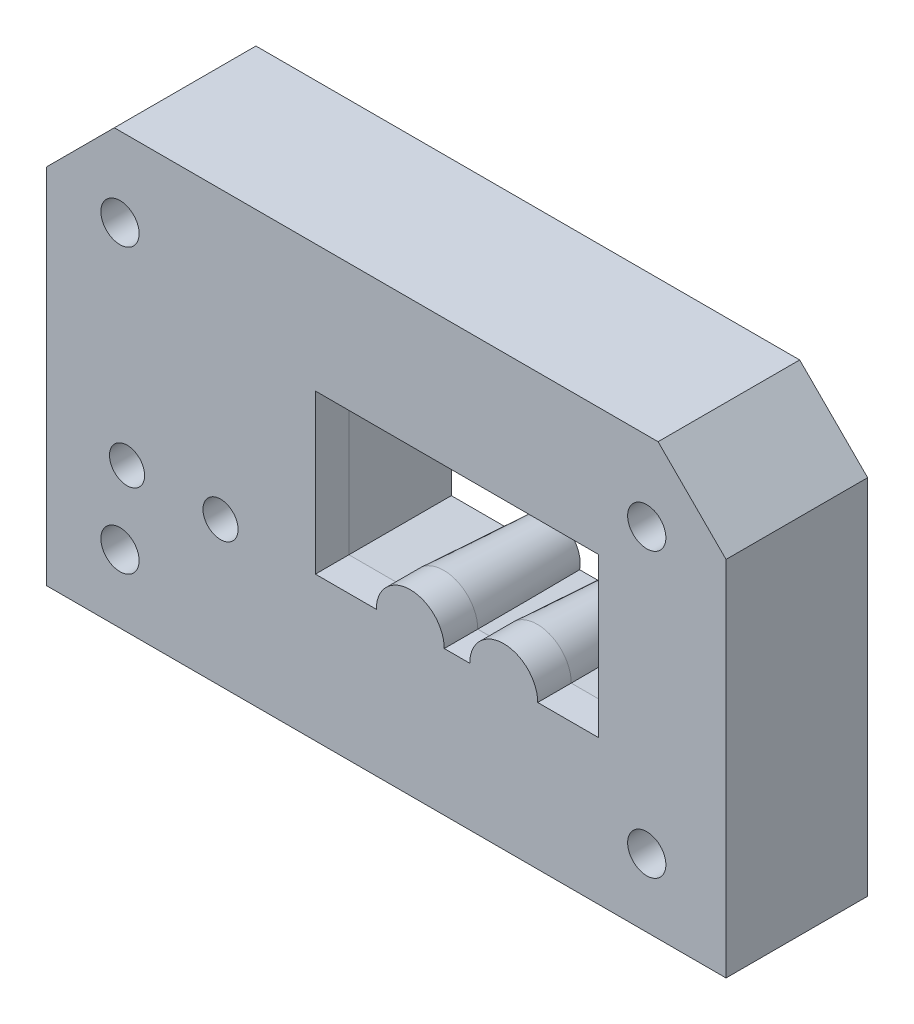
ISO-10303-21;
HEADER;
FILE_DESCRIPTION(('STEP AP214'),'2;1');
FILE_NAME('part.step','',(''),(''),'','','');
FILE_SCHEMA(('AUTOMOTIVE_DESIGN { 1 0 10303 214 1 1 1 1 }'));
ENDSEC;
DATA;
#1=APPLICATION_CONTEXT('core data for automotive mechanical design processes');
#2=APPLICATION_PROTOCOL_DEFINITION('international standard','automotive_design',2000,#1);
#3=PRODUCT_CONTEXT('',#1,'mechanical');
#4=PRODUCT('Part','Part','',(#3));
#5=PRODUCT_RELATED_PRODUCT_CATEGORY('part','',(#4));
#6=PRODUCT_DEFINITION_FORMATION('','',#4);
#7=PRODUCT_DEFINITION_CONTEXT('part definition',#1,'design');
#8=PRODUCT_DEFINITION('design','',#6,#7);
#9=PRODUCT_DEFINITION_SHAPE('','',#8);
#10=(LENGTH_UNIT() NAMED_UNIT(*) SI_UNIT(.MILLI.,.METRE.));
#11=(NAMED_UNIT(*) PLANE_ANGLE_UNIT() SI_UNIT($,.RADIAN.));
#12=(NAMED_UNIT(*) SI_UNIT($,.STERADIAN.) SOLID_ANGLE_UNIT());
#13=UNCERTAINTY_MEASURE_WITH_UNIT(LENGTH_MEASURE(1.E-05),#10,'distance_accuracy_value','');
#14=(GEOMETRIC_REPRESENTATION_CONTEXT(3) GLOBAL_UNCERTAINTY_ASSIGNED_CONTEXT((#13)) GLOBAL_UNIT_ASSIGNED_CONTEXT((#10,
#11,#12)) REPRESENTATION_CONTEXT('',''));
#15=CARTESIAN_POINT('',(0.,0.,0.));
#16=DIRECTION('',(0.,0.,1.));
#17=DIRECTION('',(1.,0.,0.));
#18=AXIS2_PLACEMENT_3D('',#15,#16,#17);
#19=CARTESIAN_POINT('',(205.,123.,25.));
#20=DIRECTION('',(0.,0.,-1.));
#21=DIRECTION('',(-1.,0.,0.));
#22=AXIS2_PLACEMENT_3D('',#19,#20,#21);
#23=PLANE('',#22);
#24=CARTESIAN_POINT('',(218.,185.,25.));
#25=DIRECTION('',(0.,0.,-1.));
#26=DIRECTION('',(-1.,0.,0.));
#27=AXIS2_PLACEMENT_3D('',#24,#25,#26);
#28=CIRCLE('',#27,3.37500000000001);
#29=CARTESIAN_POINT('',(214.625,185.,25.));
#30=VERTEX_POINT('',#29);
#31=EDGE_CURVE('E509',#30,#30,#28,.T.);
#32=ORIENTED_EDGE('',*,*,#31,.T.);
#33=EDGE_LOOP('',(#32));
#34=FACE_BOUND('',#33,.T.);
#35=CARTESIAN_POINT('',(218.,135.,25.));
#36=DIRECTION('',(0.,0.,-1.));
#37=DIRECTION('',(-1.,0.,0.));
#38=AXIS2_PLACEMENT_3D('',#35,#36,#37);
#39=CIRCLE('',#38,3.37500000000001);
#40=CARTESIAN_POINT('',(214.625,135.,25.));
#41=VERTEX_POINT('',#40);
#42=EDGE_CURVE('E503',#41,#41,#39,.T.);
#43=ORIENTED_EDGE('',*,*,#42,.T.);
#44=EDGE_LOOP('',(#43));
#45=FACE_BOUND('',#44,.T.);
#46=CARTESIAN_POINT('',(311.,185.,25.));
#47=DIRECTION('',(0.,0.,-1.));
#48=DIRECTION('',(-1.,0.,0.));
#49=AXIS2_PLACEMENT_3D('',#46,#47,#48);
#50=CIRCLE('',#49,3.37500000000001);
#51=CARTESIAN_POINT('',(307.625,185.,25.));
#52=VERTEX_POINT('',#51);
#53=EDGE_CURVE('E497',#52,#52,#50,.T.);
#54=ORIENTED_EDGE('',*,*,#53,.T.);
#55=EDGE_LOOP('',(#54));
#56=FACE_BOUND('',#55,.T.);
#57=CARTESIAN_POINT('',(311.,135.,25.));
#58=DIRECTION('',(0.,0.,-1.));
#59=DIRECTION('',(-1.,0.,0.));
#60=AXIS2_PLACEMENT_3D('',#57,#58,#59);
#61=CIRCLE('',#60,3.37500000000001);
#62=CARTESIAN_POINT('',(307.625,135.,25.));
#63=VERTEX_POINT('',#62);
#64=EDGE_CURVE('E491',#63,#63,#61,.T.);
#65=ORIENTED_EDGE('',*,*,#64,.T.);
#66=EDGE_LOOP('',(#65));
#67=FACE_BOUND('',#66,.T.);
#68=CARTESIAN_POINT('',(219.25,148.5,25.));
#69=DIRECTION('',(0.,0.,1.));
#70=DIRECTION('',(1.,0.,0.));
#71=AXIS2_PLACEMENT_3D('',#68,#69,#70);
#72=CIRCLE('',#71,3.09999999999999);
#73=CARTESIAN_POINT('',(222.35,148.5,25.));
#74=VERTEX_POINT('',#73);
#75=EDGE_CURVE('E259',#74,#74,#72,.T.);
#76=ORIENTED_EDGE('',*,*,#75,.F.);
#77=EDGE_LOOP('',(#76));
#78=FACE_BOUND('',#77,.T.);
#79=DIRECTION('',(-1.,0.,0.));
#80=VECTOR('',#79,1.);
#81=CARTESIAN_POINT('',(325.,199.,25.));
#82=LINE('',#81,#80);
#83=CARTESIAN_POINT('',(313.,199.,25.));
#84=VERTEX_POINT('',#83);
#85=CARTESIAN_POINT('',(217.,199.,25.));
#86=VERTEX_POINT('',#85);
#87=EDGE_CURVE('E320',#84,#86,#82,.T.);
#88=ORIENTED_EDGE('',*,*,#87,.T.);
#89=DIRECTION('',(0.707106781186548,0.707106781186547,0.));
#90=VECTOR('',#89,1.);
#91=CARTESIAN_POINT('',(205.,187.,25.));
#92=LINE('',#91,#90);
#93=CARTESIAN_POINT('',(205.,187.,25.));
#94=VERTEX_POINT('',#93);
#95=EDGE_CURVE('E345',#86,#94,#92,.F.);
#96=ORIENTED_EDGE('',*,*,#95,.T.);
#97=DIRECTION('',(0.,-1.,0.));
#98=VECTOR('',#97,1.);
#99=CARTESIAN_POINT('',(205.,123.,25.));
#100=LINE('',#99,#98);
#101=CARTESIAN_POINT('',(205.,123.,25.));
#102=VERTEX_POINT('',#101);
#103=EDGE_CURVE('E323',#94,#102,#100,.T.);
#104=ORIENTED_EDGE('',*,*,#103,.T.);
#105=DIRECTION('',(1.,0.,0.));
#106=VECTOR('',#105,1.);
#107=CARTESIAN_POINT('',(325.,123.,25.));
#108=LINE('',#107,#106);
#109=CARTESIAN_POINT('',(325.,123.,25.));
#110=VERTEX_POINT('',#109);
#111=EDGE_CURVE('E314',#102,#110,#108,.T.);
#112=ORIENTED_EDGE('',*,*,#111,.T.);
#113=DIRECTION('',(0.,1.,0.));
#114=VECTOR('',#113,1.);
#115=CARTESIAN_POINT('',(325.,123.,25.));
#116=LINE('',#115,#114);
#117=CARTESIAN_POINT('',(325.,187.,25.));
#118=VERTEX_POINT('',#117);
#119=EDGE_CURVE('E317',#110,#118,#116,.T.);
#120=ORIENTED_EDGE('',*,*,#119,.T.);
#121=DIRECTION('',(0.707106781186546,-0.707106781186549,0.));
#122=VECTOR('',#121,1.);
#123=CARTESIAN_POINT('',(313.,199.,25.));
#124=LINE('',#123,#122);
#125=EDGE_CURVE('E343',#118,#84,#124,.F.);
#126=ORIENTED_EDGE('',*,*,#125,.T.);
#127=EDGE_LOOP('',(#88,#96,#104,#112,#120,#126));
#128=FACE_BOUND('',#127,.T.);
#129=CARTESIAN_POINT('',(269.25,148.5,25.));
#130=DIRECTION('',(0.,0.,-1.));
#131=DIRECTION('',(1.,0.,0.));
#132=AXIS2_PLACEMENT_3D('',#129,#130,#131);
#133=CIRCLE('',#132,6.00000000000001);
#134=CARTESIAN_POINT('',(263.25,148.5,25.));
#135=VERTEX_POINT('',#134);
#136=CARTESIAN_POINT('',(275.25,148.5,25.));
#137=VERTEX_POINT('',#136);
#138=EDGE_CURVE('E262',#135,#137,#133,.T.);
#139=ORIENTED_EDGE('',*,*,#138,.F.);
#140=DIRECTION('',(1.,0.,0.));
#141=VECTOR('',#140,1.);
#142=CARTESIAN_POINT('',(263.25,148.5,25.));
#143=LINE('',#142,#141);
#144=CARTESIAN_POINT('',(252.5,148.5,25.));
#145=VERTEX_POINT('',#144);
#146=EDGE_CURVE('E277',#145,#135,#143,.T.);
#147=ORIENTED_EDGE('',*,*,#146,.F.);
#148=DIRECTION('',(0.,-1.,0.));
#149=VECTOR('',#148,1.);
#150=CARTESIAN_POINT('',(252.5,176.5,25.));
#151=LINE('',#150,#149);
#152=CARTESIAN_POINT('',(252.5,176.5,25.));
#153=VERTEX_POINT('',#152);
#154=EDGE_CURVE('E274',#153,#145,#151,.T.);
#155=ORIENTED_EDGE('',*,*,#154,.F.);
#156=DIRECTION('',(-1.,0.,0.));
#157=VECTOR('',#156,1.);
#158=CARTESIAN_POINT('',(302.5,176.5,25.));
#159=LINE('',#158,#157);
#160=CARTESIAN_POINT('',(302.5,176.5,25.));
#161=VERTEX_POINT('',#160);
#162=EDGE_CURVE('E272',#161,#153,#159,.T.);
#163=ORIENTED_EDGE('',*,*,#162,.F.);
#164=DIRECTION('',(0.,1.,0.));
#165=VECTOR('',#164,1.);
#166=CARTESIAN_POINT('',(302.5,176.5,25.));
#167=LINE('',#166,#165);
#168=CARTESIAN_POINT('',(302.5,148.5,25.));
#169=VERTEX_POINT('',#168);
#170=EDGE_CURVE('E270',#169,#161,#167,.T.);
#171=ORIENTED_EDGE('',*,*,#170,.F.);
#172=DIRECTION('',(1.,0.,0.));
#173=VECTOR('',#172,1.);
#174=CARTESIAN_POINT('',(302.5,148.5,25.));
#175=LINE('',#174,#173);
#176=CARTESIAN_POINT('',(291.75,148.5,25.));
#177=VERTEX_POINT('',#176);
#178=EDGE_CURVE('E268',#177,#169,#175,.T.);
#179=ORIENTED_EDGE('',*,*,#178,.F.);
#180=CARTESIAN_POINT('',(285.75,148.5,25.));
#181=DIRECTION('',(0.,0.,-1.));
#182=DIRECTION('',(1.,0.,0.));
#183=AXIS2_PLACEMENT_3D('',#180,#181,#182);
#184=CIRCLE('',#183,6.00000000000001);
#185=CARTESIAN_POINT('',(279.75,148.5,25.));
#186=VERTEX_POINT('',#185);
#187=EDGE_CURVE('E266',#186,#177,#184,.T.);
#188=ORIENTED_EDGE('',*,*,#187,.F.);
#189=DIRECTION('',(1.,0.,0.));
#190=VECTOR('',#189,1.);
#191=CARTESIAN_POINT('',(279.75,148.5,25.));
#192=LINE('',#191,#190);
#193=EDGE_CURVE('E264',#137,#186,#192,.T.);
#194=ORIENTED_EDGE('',*,*,#193,.F.);
#195=EDGE_LOOP('',(#139,#147,#155,#163,#171,#179,#188,#194));
#196=FACE_BOUND('',#195,.T.);
#197=CARTESIAN_POINT('',(235.75,148.5,25.));
#198=DIRECTION('',(0.,0.,1.));
#199=DIRECTION('',(1.,0.,0.));
#200=AXIS2_PLACEMENT_3D('',#197,#198,#199);
#201=CIRCLE('',#200,3.09999999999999);
#202=CARTESIAN_POINT('',(238.85,148.5,25.));
#203=VERTEX_POINT('',#202);
#204=EDGE_CURVE('E256',#203,#203,#201,.T.);
#205=ORIENTED_EDGE('',*,*,#204,.F.);
#206=EDGE_LOOP('',(#205));
#207=FACE_BOUND('',#206,.T.);
#208=ADVANCED_FACE('F31',(#34,#45,#56,#67,#78,#128,#196,#207),#23,.F.);
#209=CARTESIAN_POINT('',(205.,123.,0.));
#210=DIRECTION('',(0.,0.,-1.));
#211=DIRECTION('',(-1.,0.,0.));
#212=AXIS2_PLACEMENT_3D('',#209,#210,#211);
#213=PLANE('',#212);
#214=CARTESIAN_POINT('',(218.,185.,0.));
#215=DIRECTION('',(0.,0.,-1.));
#216=DIRECTION('',(-1.,0.,0.));
#217=AXIS2_PLACEMENT_3D('',#214,#215,#216);
#218=CIRCLE('',#217,3.37500000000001);
#219=CARTESIAN_POINT('',(214.625,185.,0.));
#220=VERTEX_POINT('',#219);
#221=EDGE_CURVE('E511',#220,#220,#218,.T.);
#222=ORIENTED_EDGE('',*,*,#221,.F.);
#223=EDGE_LOOP('',(#222));
#224=FACE_BOUND('',#223,.T.);
#225=CARTESIAN_POINT('',(218.,135.,0.));
#226=DIRECTION('',(0.,0.,-1.));
#227=DIRECTION('',(-1.,0.,0.));
#228=AXIS2_PLACEMENT_3D('',#225,#226,#227);
#229=CIRCLE('',#228,3.37500000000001);
#230=CARTESIAN_POINT('',(214.625,135.,0.));
#231=VERTEX_POINT('',#230);
#232=EDGE_CURVE('E506',#231,#231,#229,.T.);
#233=ORIENTED_EDGE('',*,*,#232,.F.);
#234=EDGE_LOOP('',(#233));
#235=FACE_BOUND('',#234,.T.);
#236=CARTESIAN_POINT('',(311.,185.,0.));
#237=DIRECTION('',(0.,0.,-1.));
#238=DIRECTION('',(-1.,0.,0.));
#239=AXIS2_PLACEMENT_3D('',#236,#237,#238);
#240=CIRCLE('',#239,3.37500000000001);
#241=CARTESIAN_POINT('',(307.625,185.,0.));
#242=VERTEX_POINT('',#241);
#243=EDGE_CURVE('E500',#242,#242,#240,.T.);
#244=ORIENTED_EDGE('',*,*,#243,.F.);
#245=EDGE_LOOP('',(#244));
#246=FACE_BOUND('',#245,.T.);
#247=CARTESIAN_POINT('',(311.,135.,0.));
#248=DIRECTION('',(0.,0.,-1.));
#249=DIRECTION('',(-1.,0.,0.));
#250=AXIS2_PLACEMENT_3D('',#247,#248,#249);
#251=CIRCLE('',#250,3.37500000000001);
#252=CARTESIAN_POINT('',(307.625,135.,0.));
#253=VERTEX_POINT('',#252);
#254=EDGE_CURVE('E494',#253,#253,#251,.T.);
#255=ORIENTED_EDGE('',*,*,#254,.F.);
#256=EDGE_LOOP('',(#255));
#257=FACE_BOUND('',#256,.T.);
#258=CARTESIAN_POINT('',(219.25,148.5,0.));
#259=DIRECTION('',(0.,0.,-1.));
#260=DIRECTION('',(-1.,0.,0.));
#261=AXIS2_PLACEMENT_3D('',#258,#259,#260);
#262=CIRCLE('',#261,4.09999999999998);
#263=CARTESIAN_POINT('',(215.15,148.5,0.));
#264=VERTEX_POINT('',#263);
#265=EDGE_CURVE('E487',#264,#264,#262,.T.);
#266=ORIENTED_EDGE('',*,*,#265,.F.);
#267=EDGE_LOOP('',(#266));
#268=FACE_BOUND('',#267,.T.);
#269=CARTESIAN_POINT('',(269.25,148.5,0.));
#270=DIRECTION('',(0.,0.,1.));
#271=DIRECTION('',(-1.,0.,0.));
#272=AXIS2_PLACEMENT_3D('',#269,#270,#271);
#273=CIRCLE('',#272,5.00000000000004);
#274=CARTESIAN_POINT('',(274.148979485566,147.5,0.));
#275=VERTEX_POINT('',#274);
#276=CARTESIAN_POINT('',(264.351020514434,147.5,0.));
#277=VERTEX_POINT('',#276);
#278=EDGE_CURVE('E47',#275,#277,#273,.T.);
#279=ORIENTED_EDGE('',*,*,#278,.F.);
#280=DIRECTION('',(-1.,0.,0.));
#281=VECTOR('',#280,1.);
#282=CARTESIAN_POINT('',(280.851020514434,147.5,0.));
#283=LINE('',#282,#281);
#284=CARTESIAN_POINT('',(280.851020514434,147.5,0.));
#285=VERTEX_POINT('',#284);
#286=EDGE_CURVE('E190',#285,#275,#283,.T.);
#287=ORIENTED_EDGE('',*,*,#286,.F.);
#288=CARTESIAN_POINT('',(285.75,148.5,0.));
#289=DIRECTION('',(0.,0.,1.));
#290=DIRECTION('',(-1.,0.,0.));
#291=AXIS2_PLACEMENT_3D('',#288,#289,#290);
#292=CIRCLE('',#291,4.99999999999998);
#293=CARTESIAN_POINT('',(290.648979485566,147.5,0.));
#294=VERTEX_POINT('',#293);
#295=EDGE_CURVE('E187',#294,#285,#292,.T.);
#296=ORIENTED_EDGE('',*,*,#295,.F.);
#297=DIRECTION('',(-1.,0.,0.));
#298=VECTOR('',#297,1.);
#299=CARTESIAN_POINT('',(303.5,147.5,0.));
#300=LINE('',#299,#298);
#301=CARTESIAN_POINT('',(303.5,147.5,0.));
#302=VERTEX_POINT('',#301);
#303=EDGE_CURVE('E184',#302,#294,#300,.T.);
#304=ORIENTED_EDGE('',*,*,#303,.F.);
#305=DIRECTION('',(0.,-1.,0.));
#306=VECTOR('',#305,1.);
#307=CARTESIAN_POINT('',(303.5,177.5,0.));
#308=LINE('',#307,#306);
#309=CARTESIAN_POINT('',(303.5,177.5,0.));
#310=VERTEX_POINT('',#309);
#311=EDGE_CURVE('E178',#310,#302,#308,.T.);
#312=ORIENTED_EDGE('',*,*,#311,.F.);
#313=DIRECTION('',(1.,0.,0.));
#314=VECTOR('',#313,1.);
#315=CARTESIAN_POINT('',(251.5,177.5,0.));
#316=LINE('',#315,#314);
#317=CARTESIAN_POINT('',(251.5,177.5,0.));
#318=VERTEX_POINT('',#317);
#319=EDGE_CURVE('E176',#318,#310,#316,.T.);
#320=ORIENTED_EDGE('',*,*,#319,.F.);
#321=DIRECTION('',(0.,1.,0.));
#322=VECTOR('',#321,1.);
#323=CARTESIAN_POINT('',(251.5,147.5,0.));
#324=LINE('',#323,#322);
#325=CARTESIAN_POINT('',(251.5,147.5,0.));
#326=VERTEX_POINT('',#325);
#327=EDGE_CURVE('E159',#326,#318,#324,.T.);
#328=ORIENTED_EDGE('',*,*,#327,.F.);
#329=DIRECTION('',(-1.,0.,0.));
#330=VECTOR('',#329,1.);
#331=CARTESIAN_POINT('',(264.351020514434,147.5,0.));
#332=LINE('',#331,#330);
#333=EDGE_CURVE('E168',#277,#326,#332,.T.);
#334=ORIENTED_EDGE('',*,*,#333,.F.);
#335=EDGE_LOOP('',(#279,#287,#296,#304,#312,#320,#328,#334));
#336=FACE_BOUND('',#335,.T.);
#337=CARTESIAN_POINT('',(235.75,148.5,0.));
#338=DIRECTION('',(0.,0.,-1.));
#339=DIRECTION('',(-1.,0.,0.));
#340=AXIS2_PLACEMENT_3D('',#337,#338,#339);
#341=CIRCLE('',#340,4.09999999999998);
#342=CARTESIAN_POINT('',(231.65,148.5,0.));
#343=VERTEX_POINT('',#342);
#344=EDGE_CURVE('E252',#343,#343,#341,.T.);
#345=ORIENTED_EDGE('',*,*,#344,.F.);
#346=EDGE_LOOP('',(#345));
#347=FACE_BOUND('',#346,.T.);
#348=DIRECTION('',(0.,-1.,0.));
#349=VECTOR('',#348,1.);
#350=CARTESIAN_POINT('',(205.,123.,0.));
#351=LINE('',#350,#349);
#352=CARTESIAN_POINT('',(205.,187.,0.));
#353=VERTEX_POINT('',#352);
#354=CARTESIAN_POINT('',(205.,123.,0.));
#355=VERTEX_POINT('',#354);
#356=EDGE_CURVE('E312',#353,#355,#351,.T.);
#357=ORIENTED_EDGE('',*,*,#356,.F.);
#358=DIRECTION('',(-0.707106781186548,-0.707106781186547,0.));
#359=VECTOR('',#358,1.);
#360=CARTESIAN_POINT('',(173.,155.,0.));
#361=LINE('',#360,#359);
#362=CARTESIAN_POINT('',(217.,199.,0.));
#363=VERTEX_POINT('',#362);
#364=EDGE_CURVE('E336',#353,#363,#361,.F.);
#365=ORIENTED_EDGE('',*,*,#364,.T.);
#366=DIRECTION('',(-1.,0.,0.));
#367=VECTOR('',#366,1.);
#368=CARTESIAN_POINT('',(325.,199.,0.));
#369=LINE('',#368,#367);
#370=CARTESIAN_POINT('',(313.,199.,0.));
#371=VERTEX_POINT('',#370);
#372=EDGE_CURVE('E309',#371,#363,#369,.T.);
#373=ORIENTED_EDGE('',*,*,#372,.F.);
#374=DIRECTION('',(-0.707106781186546,0.707106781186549,0.));
#375=VECTOR('',#374,1.);
#376=CARTESIAN_POINT('',(297.,215.,0.));
#377=LINE('',#376,#375);
#378=CARTESIAN_POINT('',(325.,187.,0.));
#379=VERTEX_POINT('',#378);
#380=EDGE_CURVE('E334',#371,#379,#377,.F.);
#381=ORIENTED_EDGE('',*,*,#380,.T.);
#382=DIRECTION('',(0.,1.,0.));
#383=VECTOR('',#382,1.);
#384=CARTESIAN_POINT('',(325.,123.,0.));
#385=LINE('',#384,#383);
#386=CARTESIAN_POINT('',(325.,123.,0.));
#387=VERTEX_POINT('',#386);
#388=EDGE_CURVE('E306',#387,#379,#385,.T.);
#389=ORIENTED_EDGE('',*,*,#388,.F.);
#390=DIRECTION('',(1.,0.,0.));
#391=VECTOR('',#390,1.);
#392=CARTESIAN_POINT('',(325.,123.,0.));
#393=LINE('',#392,#391);
#394=EDGE_CURVE('E303',#355,#387,#393,.T.);
#395=ORIENTED_EDGE('',*,*,#394,.F.);
#396=EDGE_LOOP('',(#357,#365,#373,#381,#389,#395));
#397=FACE_BOUND('',#396,.T.);
#398=ADVANCED_FACE('F172',(#224,#235,#246,#257,#268,#336,#347,#397),#213,.T.);
#399=CARTESIAN_POINT('',(325.,123.,25.));
#400=DIRECTION('',(0.,1.,0.));
#401=DIRECTION('',(-1.,0.,0.));
#402=AXIS2_PLACEMENT_3D('',#399,#400,#401);
#403=PLANE('',#402);
#404=ORIENTED_EDGE('',*,*,#394,.T.);
#405=DIRECTION('',(0.,0.,-1.));
#406=VECTOR('',#405,1.);
#407=CARTESIAN_POINT('',(325.,123.,25.));
#408=LINE('',#407,#406);
#409=EDGE_CURVE('E328',#110,#387,#408,.T.);
#410=ORIENTED_EDGE('',*,*,#409,.F.);
#411=ORIENTED_EDGE('',*,*,#111,.F.);
#412=DIRECTION('',(0.,0.,-1.));
#413=VECTOR('',#412,1.);
#414=CARTESIAN_POINT('',(205.,123.,25.));
#415=LINE('',#414,#413);
#416=EDGE_CURVE('E325',#102,#355,#415,.T.);
#417=ORIENTED_EDGE('',*,*,#416,.T.);
#418=EDGE_LOOP('',(#404,#410,#411,#417));
#419=FACE_BOUND('',#418,.T.);
#420=ADVANCED_FACE('F33',(#419),#403,.F.);
#421=CARTESIAN_POINT('',(325.,123.,25.));
#422=DIRECTION('',(-1.,0.,0.));
#423=DIRECTION('',(0.,0.,1.));
#424=AXIS2_PLACEMENT_3D('',#421,#422,#423);
#425=PLANE('',#424);
#426=ORIENTED_EDGE('',*,*,#388,.T.);
#427=DIRECTION('',(0.,0.,1.));
#428=VECTOR('',#427,1.);
#429=CARTESIAN_POINT('',(325.,187.,25.));
#430=LINE('',#429,#428);
#431=EDGE_CURVE('E40',#379,#118,#430,.T.);
#432=ORIENTED_EDGE('',*,*,#431,.T.);
#433=ORIENTED_EDGE('',*,*,#119,.F.);
#434=ORIENTED_EDGE('',*,*,#409,.T.);
#435=EDGE_LOOP('',(#426,#432,#433,#434));
#436=FACE_BOUND('',#435,.T.);
#437=ADVANCED_FACE('F380',(#436),#425,.F.);
#438=CARTESIAN_POINT('',(325.,199.,25.));
#439=DIRECTION('',(0.,-1.,0.));
#440=DIRECTION('',(1.,0.,0.));
#441=AXIS2_PLACEMENT_3D('',#438,#439,#440);
#442=PLANE('',#441);
#443=ORIENTED_EDGE('',*,*,#372,.T.);
#444=DIRECTION('',(0.,0.,1.));
#445=VECTOR('',#444,1.);
#446=CARTESIAN_POINT('',(217.,199.,25.));
#447=LINE('',#446,#445);
#448=EDGE_CURVE('E341',#363,#86,#447,.T.);
#449=ORIENTED_EDGE('',*,*,#448,.T.);
#450=ORIENTED_EDGE('',*,*,#87,.F.);
#451=DIRECTION('',(0.,0.,-1.));
#452=VECTOR('',#451,1.);
#453=CARTESIAN_POINT('',(313.,199.,25.));
#454=LINE('',#453,#452);
#455=EDGE_CURVE('E338',#84,#371,#454,.T.);
#456=ORIENTED_EDGE('',*,*,#455,.T.);
#457=EDGE_LOOP('',(#443,#449,#450,#456));
#458=FACE_BOUND('',#457,.T.);
#459=ADVANCED_FACE('F377',(#458),#442,.F.);
#460=CARTESIAN_POINT('',(205.,123.,25.));
#461=DIRECTION('',(1.,0.,0.));
#462=DIRECTION('',(0.,0.,-1.));
#463=AXIS2_PLACEMENT_3D('',#460,#461,#462);
#464=PLANE('',#463);
#465=ORIENTED_EDGE('',*,*,#103,.F.);
#466=DIRECTION('',(0.,0.,-1.));
#467=VECTOR('',#466,1.);
#468=CARTESIAN_POINT('',(205.,187.,25.));
#469=LINE('',#468,#467);
#470=EDGE_CURVE('E331',#94,#353,#469,.T.);
#471=ORIENTED_EDGE('',*,*,#470,.T.);
#472=ORIENTED_EDGE('',*,*,#356,.T.);
#473=ORIENTED_EDGE('',*,*,#416,.F.);
#474=EDGE_LOOP('',(#465,#471,#472,#473));
#475=FACE_BOUND('',#474,.T.);
#476=ADVANCED_FACE('F373',(#475),#464,.F.);
#477=CARTESIAN_POINT('',(269.25,148.5,25.));
#478=DIRECTION('',(0.,0.,-1.));
#479=DIRECTION('',(-1.,0.,0.));
#480=AXIS2_PLACEMENT_3D('',#477,#478,#479);
#481=CYLINDRICAL_SURFACE('',#480,6.00000000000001);
#482=CARTESIAN_POINT('',(269.25,148.5,19.0811366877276));
#483=DIRECTION('',(0.,0.,1.));
#484=DIRECTION('',(1.,0.,0.));
#485=AXIS2_PLACEMENT_3D('',#482,#483,#484);
#486=CIRCLE('',#485,6.00000000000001);
#487=CARTESIAN_POINT('',(263.25,148.5,19.0811366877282));
#488=VERTEX_POINT('',#487);
#489=CARTESIAN_POINT('',(275.25,148.5,19.0811366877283));
#490=VERTEX_POINT('',#489);
#491=EDGE_CURVE('E240',#488,#490,#486,.F.);
#492=ORIENTED_EDGE('',*,*,#491,.F.);
#493=DIRECTION('',(0.,0.,-1.));
#494=VECTOR('',#493,1.);
#495=CARTESIAN_POINT('',(263.25,148.5,25.));
#496=LINE('',#495,#494);
#497=EDGE_CURVE('E279',#135,#488,#496,.T.);
#498=ORIENTED_EDGE('',*,*,#497,.F.);
#499=ORIENTED_EDGE('',*,*,#138,.T.);
#500=DIRECTION('',(0.,0.,-1.));
#501=VECTOR('',#500,1.);
#502=CARTESIAN_POINT('',(275.25,148.5,25.));
#503=LINE('',#502,#501);
#504=EDGE_CURVE('E300',#137,#490,#503,.T.);
#505=ORIENTED_EDGE('',*,*,#504,.T.);
#506=EDGE_LOOP('',(#492,#498,#499,#505));
#507=FACE_BOUND('',#506,.T.);
#508=ADVANCED_FACE('F376',(#507),#481,.T.);
#509=CARTESIAN_POINT('',(279.75,148.5,25.));
#510=DIRECTION('',(0.,1.,0.));
#511=DIRECTION('',(-1.,0.,0.));
#512=AXIS2_PLACEMENT_3D('',#509,#510,#511);
#513=PLANE('',#512);
#514=DIRECTION('',(1.,0.,0.));
#515=VECTOR('',#514,1.);
#516=CARTESIAN_POINT('',(279.75,148.5,19.0811366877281));
#517=LINE('',#516,#515);
#518=CARTESIAN_POINT('',(279.75,148.5,19.0811366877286));
#519=VERTEX_POINT('',#518);
#520=EDGE_CURVE('E250',#490,#519,#517,.T.);
#521=ORIENTED_EDGE('',*,*,#520,.F.);
#522=ORIENTED_EDGE('',*,*,#504,.F.);
#523=ORIENTED_EDGE('',*,*,#193,.T.);
#524=DIRECTION('',(0.,0.,-1.));
#525=VECTOR('',#524,1.);
#526=CARTESIAN_POINT('',(279.75,148.5,25.));
#527=LINE('',#526,#525);
#528=EDGE_CURVE('E297',#186,#519,#527,.T.);
#529=ORIENTED_EDGE('',*,*,#528,.T.);
#530=EDGE_LOOP('',(#521,#522,#523,#529));
#531=FACE_BOUND('',#530,.T.);
#532=ADVANCED_FACE('F442',(#531),#513,.T.);
#533=CARTESIAN_POINT('',(285.75,148.5,25.));
#534=DIRECTION('',(0.,0.,-1.));
#535=DIRECTION('',(-1.,0.,0.));
#536=AXIS2_PLACEMENT_3D('',#533,#534,#535);
#537=CYLINDRICAL_SURFACE('',#536,6.00000000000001);
#538=CARTESIAN_POINT('',(285.75,148.5,19.0811366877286));
#539=DIRECTION('',(0.,0.,1.));
#540=DIRECTION('',(1.,0.,0.));
#541=AXIS2_PLACEMENT_3D('',#538,#539,#540);
#542=CIRCLE('',#541,6.00000000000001);
#543=CARTESIAN_POINT('',(291.75,148.5,19.0811366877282));
#544=VERTEX_POINT('',#543);
#545=EDGE_CURVE('E248',#519,#544,#542,.F.);
#546=ORIENTED_EDGE('',*,*,#545,.F.);
#547=ORIENTED_EDGE('',*,*,#528,.F.);
#548=ORIENTED_EDGE('',*,*,#187,.T.);
#549=DIRECTION('',(0.,0.,-1.));
#550=VECTOR('',#549,1.);
#551=CARTESIAN_POINT('',(291.75,148.5,25.));
#552=LINE('',#551,#550);
#553=EDGE_CURVE('E294',#177,#544,#552,.T.);
#554=ORIENTED_EDGE('',*,*,#553,.T.);
#555=EDGE_LOOP('',(#546,#547,#548,#554));
#556=FACE_BOUND('',#555,.T.);
#557=ADVANCED_FACE('F438',(#556),#537,.T.);
#558=CARTESIAN_POINT('',(302.5,148.5,25.));
#559=DIRECTION('',(0.,1.,0.));
#560=DIRECTION('',(0.,0.,1.));
#561=AXIS2_PLACEMENT_3D('',#558,#559,#560);
#562=PLANE('',#561);
#563=DIRECTION('',(1.,0.,0.));
#564=VECTOR('',#563,1.);
#565=CARTESIAN_POINT('',(302.5,148.5,19.0811366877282));
#566=LINE('',#565,#564);
#567=CARTESIAN_POINT('',(302.5,148.5,19.0811366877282));
#568=VERTEX_POINT('',#567);
#569=EDGE_CURVE('E246',#544,#568,#566,.T.);
#570=ORIENTED_EDGE('',*,*,#569,.F.);
#571=ORIENTED_EDGE('',*,*,#553,.F.);
#572=ORIENTED_EDGE('',*,*,#178,.T.);
#573=DIRECTION('',(0.,0.,-1.));
#574=VECTOR('',#573,1.);
#575=CARTESIAN_POINT('',(302.5,148.5,25.));
#576=LINE('',#575,#574);
#577=EDGE_CURVE('E291',#169,#568,#576,.T.);
#578=ORIENTED_EDGE('',*,*,#577,.T.);
#579=EDGE_LOOP('',(#570,#571,#572,#578));
#580=FACE_BOUND('',#579,.T.);
#581=ADVANCED_FACE('F434',(#580),#562,.T.);
#582=CARTESIAN_POINT('',(302.5,176.5,25.));
#583=DIRECTION('',(-1.,0.,0.));
#584=DIRECTION('',(0.,0.,1.));
#585=AXIS2_PLACEMENT_3D('',#582,#583,#584);
#586=PLANE('',#585);
#587=DIRECTION('',(0.,1.,0.));
#588=VECTOR('',#587,1.);
#589=CARTESIAN_POINT('',(302.5,176.5,19.0811366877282));
#590=LINE('',#589,#588);
#591=CARTESIAN_POINT('',(302.5,176.5,19.0811366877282));
#592=VERTEX_POINT('',#591);
#593=EDGE_CURVE('E244',#568,#592,#590,.T.);
#594=ORIENTED_EDGE('',*,*,#593,.F.);
#595=ORIENTED_EDGE('',*,*,#577,.F.);
#596=ORIENTED_EDGE('',*,*,#170,.T.);
#597=DIRECTION('',(0.,0.,-1.));
#598=VECTOR('',#597,1.);
#599=CARTESIAN_POINT('',(302.5,176.5,25.));
#600=LINE('',#599,#598);
#601=EDGE_CURVE('E288',#161,#592,#600,.T.);
#602=ORIENTED_EDGE('',*,*,#601,.T.);
#603=EDGE_LOOP('',(#594,#595,#596,#602));
#604=FACE_BOUND('',#603,.T.);
#605=ADVANCED_FACE('F430',(#604),#586,.T.);
#606=CARTESIAN_POINT('',(302.5,176.5,25.));
#607=DIRECTION('',(0.,-1.,0.));
#608=DIRECTION('',(1.,0.,0.));
#609=AXIS2_PLACEMENT_3D('',#606,#607,#608);
#610=PLANE('',#609);
#611=DIRECTION('',(-1.,0.,0.));
#612=VECTOR('',#611,1.);
#613=CARTESIAN_POINT('',(302.5,176.5,19.0811366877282));
#614=LINE('',#613,#612);
#615=CARTESIAN_POINT('',(252.5,176.5,19.0811366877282));
#616=VERTEX_POINT('',#615);
#617=EDGE_CURVE('E242',#592,#616,#614,.T.);
#618=ORIENTED_EDGE('',*,*,#617,.F.);
#619=ORIENTED_EDGE('',*,*,#601,.F.);
#620=ORIENTED_EDGE('',*,*,#162,.T.);
#621=DIRECTION('',(0.,0.,-1.));
#622=VECTOR('',#621,1.);
#623=CARTESIAN_POINT('',(252.5,176.5,25.));
#624=LINE('',#623,#622);
#625=EDGE_CURVE('E285',#153,#616,#624,.T.);
#626=ORIENTED_EDGE('',*,*,#625,.T.);
#627=EDGE_LOOP('',(#618,#619,#620,#626));
#628=FACE_BOUND('',#627,.T.);
#629=ADVANCED_FACE('F426',(#628),#610,.T.);
#630=CARTESIAN_POINT('',(252.5,176.5,25.));
#631=DIRECTION('',(1.,0.,0.));
#632=DIRECTION('',(0.,0.,-1.));
#633=AXIS2_PLACEMENT_3D('',#630,#631,#632);
#634=PLANE('',#633);
#635=DIRECTION('',(0.,-1.,0.));
#636=VECTOR('',#635,1.);
#637=CARTESIAN_POINT('',(252.5,176.5,19.0811366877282));
#638=LINE('',#637,#636);
#639=CARTESIAN_POINT('',(252.5,148.5,19.0811366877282));
#640=VERTEX_POINT('',#639);
#641=EDGE_CURVE('E162',#616,#640,#638,.T.);
#642=ORIENTED_EDGE('',*,*,#641,.F.);
#643=ORIENTED_EDGE('',*,*,#625,.F.);
#644=ORIENTED_EDGE('',*,*,#154,.T.);
#645=DIRECTION('',(0.,0.,-1.));
#646=VECTOR('',#645,1.);
#647=CARTESIAN_POINT('',(252.5,148.5,25.));
#648=LINE('',#647,#646);
#649=EDGE_CURVE('E282',#145,#640,#648,.T.);
#650=ORIENTED_EDGE('',*,*,#649,.T.);
#651=EDGE_LOOP('',(#642,#643,#644,#650));
#652=FACE_BOUND('',#651,.T.);
#653=ADVANCED_FACE('F422',(#652),#634,.T.);
#654=CARTESIAN_POINT('',(263.25,148.5,25.));
#655=DIRECTION('',(0.,1.,0.));
#656=DIRECTION('',(0.,0.,1.));
#657=AXIS2_PLACEMENT_3D('',#654,#655,#656);
#658=PLANE('',#657);
#659=DIRECTION('',(1.,0.,0.));
#660=VECTOR('',#659,1.);
#661=CARTESIAN_POINT('',(263.25,148.5,19.0811366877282));
#662=LINE('',#661,#660);
#663=EDGE_CURVE('E11',#640,#488,#662,.T.);
#664=ORIENTED_EDGE('',*,*,#663,.F.);
#665=ORIENTED_EDGE('',*,*,#649,.F.);
#666=ORIENTED_EDGE('',*,*,#146,.T.);
#667=ORIENTED_EDGE('',*,*,#497,.T.);
#668=EDGE_LOOP('',(#664,#665,#666,#667));
#669=FACE_BOUND('',#668,.T.);
#670=ADVANCED_FACE('F418',(#669),#658,.T.);
#671=CARTESIAN_POINT('',(219.25,148.5,25.));
#672=DIRECTION('',(0.,0.,-1.));
#673=DIRECTION('',(-1.,0.,0.));
#674=AXIS2_PLACEMENT_3D('',#671,#672,#673);
#675=CYLINDRICAL_SURFACE('',#674,3.09999999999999);
#676=CARTESIAN_POINT('',(219.25,148.5,19.0811366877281));
#677=DIRECTION('',(0.,0.,-1.));
#678=DIRECTION('',(-1.,0.,0.));
#679=AXIS2_PLACEMENT_3D('',#676,#677,#678);
#680=CIRCLE('',#679,3.09999999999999);
#681=CARTESIAN_POINT('',(216.15,148.5,19.0811366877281));
#682=VERTEX_POINT('',#681);
#683=EDGE_CURVE('E35',#682,#682,#680,.F.);
#684=ORIENTED_EDGE('',*,*,#683,.F.);
#685=EDGE_LOOP('',(#684));
#686=FACE_BOUND('',#685,.T.);
#687=ORIENTED_EDGE('',*,*,#75,.T.);
#688=EDGE_LOOP('',(#687));
#689=FACE_BOUND('',#688,.T.);
#690=ADVANCED_FACE('F357',(#686,#689),#675,.F.);
#691=CARTESIAN_POINT('',(235.75,148.5,25.));
#692=DIRECTION('',(0.,0.,-1.));
#693=DIRECTION('',(-1.,0.,0.));
#694=AXIS2_PLACEMENT_3D('',#691,#692,#693);
#695=CYLINDRICAL_SURFACE('',#694,3.09999999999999);
#696=CARTESIAN_POINT('',(235.75,148.5,19.0811366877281));
#697=DIRECTION('',(0.,0.,-1.));
#698=DIRECTION('',(-1.,0.,0.));
#699=AXIS2_PLACEMENT_3D('',#696,#697,#698);
#700=CIRCLE('',#699,3.09999999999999);
#701=CARTESIAN_POINT('',(232.65,148.5,19.0811366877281));
#702=VERTEX_POINT('',#701);
#703=EDGE_CURVE('E255',#702,#702,#700,.F.);
#704=ORIENTED_EDGE('',*,*,#703,.F.);
#705=EDGE_LOOP('',(#704));
#706=FACE_BOUND('',#705,.T.);
#707=ORIENTED_EDGE('',*,*,#204,.T.);
#708=EDGE_LOOP('',(#707));
#709=FACE_BOUND('',#708,.T.);
#710=ADVANCED_FACE('F353',(#706,#709),#695,.F.);
#711=CARTESIAN_POINT('',(205.,187.,25.));
#712=DIRECTION('',(0.707106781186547,-0.707106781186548,0.));
#713=DIRECTION('',(0.707106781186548,0.707106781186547,0.));
#714=AXIS2_PLACEMENT_3D('',#711,#712,#713);
#715=PLANE('',#714);
#716=ORIENTED_EDGE('',*,*,#95,.F.);
#717=ORIENTED_EDGE('',*,*,#448,.F.);
#718=ORIENTED_EDGE('',*,*,#364,.F.);
#719=ORIENTED_EDGE('',*,*,#470,.F.);
#720=EDGE_LOOP('',(#716,#717,#718,#719));
#721=FACE_BOUND('',#720,.T.);
#722=ADVANCED_FACE('F356',(#721),#715,.F.);
#723=CARTESIAN_POINT('',(313.,199.,25.));
#724=DIRECTION('',(-0.707106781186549,-0.707106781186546,0.));
#725=DIRECTION('',(0.707106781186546,-0.707106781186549,0.));
#726=AXIS2_PLACEMENT_3D('',#723,#724,#725);
#727=PLANE('',#726);
#728=ORIENTED_EDGE('',*,*,#125,.F.);
#729=ORIENTED_EDGE('',*,*,#431,.F.);
#730=ORIENTED_EDGE('',*,*,#380,.F.);
#731=ORIENTED_EDGE('',*,*,#455,.F.);
#732=EDGE_LOOP('',(#728,#729,#730,#731));
#733=FACE_BOUND('',#732,.T.);
#734=ADVANCED_FACE('F394',(#733),#727,.F.);
#735=CARTESIAN_POINT('',(235.75,148.5,0.));
#736=DIRECTION('',(0.,0.,-1.));
#737=DIRECTION('',(-1.,0.,0.));
#738=AXIS2_PLACEMENT_3D('',#735,#736,#737);
#739=CONICAL_SURFACE('',#738,4.09999999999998,0.05235987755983);
#740=ORIENTED_EDGE('',*,*,#703,.T.);
#741=EDGE_LOOP('',(#740));
#742=FACE_BOUND('',#741,.T.);
#743=ORIENTED_EDGE('',*,*,#344,.T.);
#744=EDGE_LOOP('',(#743));
#745=FACE_BOUND('',#744,.T.);
#746=ADVANCED_FACE('F211',(#742,#745),#739,.F.);
#747=CARTESIAN_POINT('',(269.25,148.5,0.));
#748=DIRECTION('',(0.,0.,1.));
#749=DIRECTION('',(-1.,0.,0.));
#750=AXIS2_PLACEMENT_3D('',#747,#748,#749);
#751=CONICAL_SURFACE('',#750,5.00000000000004,0.05235987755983);
#752=ORIENTED_EDGE('',*,*,#491,.T.);
#753=CARTESIAN_POINT('',(275.55256565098,148.810194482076,25.));
#754=CARTESIAN_POINT('',(275.453063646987,148.705714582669,23.0064047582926));
#755=CARTESIAN_POINT('',(275.351285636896,148.601240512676,21.0129207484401));
#756=CARTESIAN_POINT('',(275.14226172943,148.392308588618,17.0262621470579));
#757=CARTESIAN_POINT('',(275.035015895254,148.287850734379,15.0330875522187));
#758=CARTESIAN_POINT('',(274.804116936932,148.069475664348,10.8662429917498));
#759=CARTESIAN_POINT('',(274.679858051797,147.955560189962,8.69260625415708));
#760=CARTESIAN_POINT('',(274.48647243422,147.784707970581,5.43255170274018));
#761=CARTESIAN_POINT('',(274.420843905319,147.727760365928,4.34592667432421));
#762=CARTESIAN_POINT('',(274.286957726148,147.613873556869,2.17283690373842));
#763=CARTESIAN_POINT('',(274.218700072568,147.556934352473,1.08637216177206));
#764=CARTESIAN_POINT('',(274.148979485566,147.5,0.));
#765=B_SPLINE_CURVE_WITH_KNOTS('',3,(#753,#754,#755,#756,#757,#758,#759,#760,#761,#762,#763,
#764),.UNSPECIFIED.,.F.,.F.,(4,2,2,2,2,4),(0.,5.99642941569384,11.992789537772,18.5332620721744,
21.8035401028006,25.0738222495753),.UNSPECIFIED.);
#766=EDGE_CURVE('E193',#490,#275,#765,.T.);
#767=ORIENTED_EDGE('',*,*,#766,.T.);
#768=ORIENTED_EDGE('',*,*,#278,.T.);
#769=CARTESIAN_POINT('',(262.94743434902,148.810194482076,25.));
#770=CARTESIAN_POINT('',(263.046936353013,148.705714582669,23.0064047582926));
#771=CARTESIAN_POINT('',(263.148714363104,148.601240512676,21.0129207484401));
#772=CARTESIAN_POINT('',(263.35773827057,148.392308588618,17.0262621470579));
#773=CARTESIAN_POINT('',(263.464984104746,148.287850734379,15.0330875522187));
#774=CARTESIAN_POINT('',(263.695883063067,148.069475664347,10.8662429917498));
#775=CARTESIAN_POINT('',(263.820141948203,147.955560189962,8.69260625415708));
#776=CARTESIAN_POINT('',(264.01352756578,147.784707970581,5.43255170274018));
#777=CARTESIAN_POINT('',(264.079156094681,147.727760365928,4.34592667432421));
#778=CARTESIAN_POINT('',(264.213042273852,147.613873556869,2.17283690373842));
#779=CARTESIAN_POINT('',(264.281299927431,147.556934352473,1.08637216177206));
#780=CARTESIAN_POINT('',(264.351020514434,147.5,0.));
#781=B_SPLINE_CURVE_WITH_KNOTS('',3,(#769,#770,#771,#772,#773,#774,#775,#776,#777,#778,#779,
#780),.UNSPECIFIED.,.F.,.F.,(4,2,2,2,2,4),(0.,5.99642941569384,11.992789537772,18.5332620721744,
21.8035401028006,25.0738222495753),.UNSPECIFIED.);
#782=EDGE_CURVE('E165',#488,#277,#781,.T.);
#783=ORIENTED_EDGE('',*,*,#782,.F.);
#784=EDGE_LOOP('',(#752,#767,#768,#783));
#785=FACE_BOUND('',#784,.T.);
#786=ADVANCED_FACE('F208',(#785),#751,.T.);
#787=CARTESIAN_POINT('',(280.851020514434,147.5,0.));
#788=DIRECTION('',(0.,-0.998629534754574,0.0523359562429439));
#789=DIRECTION('',(0.,-0.052335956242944,-0.998629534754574));
#790=AXIS2_PLACEMENT_3D('',#787,#788,#789);
#791=PLANE('',#790);
#792=ORIENTED_EDGE('',*,*,#520,.T.);
#793=CARTESIAN_POINT('',(279.44743434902,148.810194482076,25.));
#794=CARTESIAN_POINT('',(279.546936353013,148.705714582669,23.0064047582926));
#795=CARTESIAN_POINT('',(279.648714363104,148.601240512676,21.0129207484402));
#796=CARTESIAN_POINT('',(279.85773827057,148.392308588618,17.0262621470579));
#797=CARTESIAN_POINT('',(279.964984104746,148.287850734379,15.0330875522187));
#798=CARTESIAN_POINT('',(280.195883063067,148.069475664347,10.8662429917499));
#799=CARTESIAN_POINT('',(280.320141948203,147.955560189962,8.69260625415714));
#800=CARTESIAN_POINT('',(280.51352756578,147.784707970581,5.43255170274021));
#801=CARTESIAN_POINT('',(280.579156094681,147.727760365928,4.34592667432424));
#802=CARTESIAN_POINT('',(280.713042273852,147.613873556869,2.17283690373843));
#803=CARTESIAN_POINT('',(280.781299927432,147.556934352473,1.08637216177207));
#804=CARTESIAN_POINT('',(280.851020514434,147.5,0.));
#805=B_SPLINE_CURVE_WITH_KNOTS('',3,(#793,#794,#795,#796,#797,#798,#799,#800,#801,#802,#803,
#804),.UNSPECIFIED.,.F.,.F.,(4,2,2,2,2,4),(0.,5.99642941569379,11.9927895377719,
18.5332620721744,21.8035401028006,25.0738222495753),.UNSPECIFIED.);
#806=EDGE_CURVE('E200',#519,#285,#805,.T.);
#807=ORIENTED_EDGE('',*,*,#806,.T.);
#808=ORIENTED_EDGE('',*,*,#286,.T.);
#809=ORIENTED_EDGE('',*,*,#766,.F.);
#810=EDGE_LOOP('',(#792,#807,#808,#809));
#811=FACE_BOUND('',#810,.T.);
#812=ADVANCED_FACE('F205',(#811),#791,.F.);
#813=CARTESIAN_POINT('',(285.75,148.5,0.));
#814=DIRECTION('',(0.,0.,1.));
#815=DIRECTION('',(-1.,0.,0.));
#816=AXIS2_PLACEMENT_3D('',#813,#814,#815);
#817=CONICAL_SURFACE('',#816,4.99999999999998,0.05235987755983);
#818=ORIENTED_EDGE('',*,*,#545,.T.);
#819=CARTESIAN_POINT('',(292.05256565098,148.810194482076,25.));
#820=CARTESIAN_POINT('',(291.953063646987,148.705714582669,23.0064047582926));
#821=CARTESIAN_POINT('',(291.851285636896,148.601240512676,21.0129207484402));
#822=CARTESIAN_POINT('',(291.64226172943,148.392308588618,17.0262621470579));
#823=CARTESIAN_POINT('',(291.535015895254,148.287850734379,15.0330875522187));
#824=CARTESIAN_POINT('',(291.304116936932,148.069475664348,10.8662429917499));
#825=CARTESIAN_POINT('',(291.179858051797,147.955560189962,8.69260625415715));
#826=CARTESIAN_POINT('',(290.98647243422,147.784707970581,5.43255170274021));
#827=CARTESIAN_POINT('',(290.920843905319,147.727760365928,4.34592667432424));
#828=CARTESIAN_POINT('',(290.786957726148,147.613873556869,2.17283690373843));
#829=CARTESIAN_POINT('',(290.718700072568,147.556934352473,1.08637216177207));
#830=CARTESIAN_POINT('',(290.648979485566,147.5,0.));
#831=B_SPLINE_CURVE_WITH_KNOTS('',3,(#819,#820,#821,#822,#823,#824,#825,#826,#827,#828,#829,
#830),.UNSPECIFIED.,.F.,.F.,(4,2,2,2,2,4),(0.,5.99642941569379,11.9927895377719,
18.5332620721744,21.8035401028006,25.0738222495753),.UNSPECIFIED.);
#832=EDGE_CURVE('E227',#544,#294,#831,.T.);
#833=ORIENTED_EDGE('',*,*,#832,.T.);
#834=ORIENTED_EDGE('',*,*,#295,.T.);
#835=ORIENTED_EDGE('',*,*,#806,.F.);
#836=EDGE_LOOP('',(#818,#833,#834,#835));
#837=FACE_BOUND('',#836,.T.);
#838=ADVANCED_FACE('F222',(#837),#817,.T.);
#839=CARTESIAN_POINT('',(303.5,147.5,0.));
#840=DIRECTION('',(0.,-0.998629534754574,0.0523359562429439));
#841=DIRECTION('',(0.,-0.052335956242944,-0.998629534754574));
#842=AXIS2_PLACEMENT_3D('',#839,#840,#841);
#843=PLANE('',#842);
#844=ORIENTED_EDGE('',*,*,#569,.T.);
#845=DIRECTION('',(0.052264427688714,-0.052264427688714,-0.997264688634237));
#846=VECTOR('',#845,1.);
#847=CARTESIAN_POINT('',(303.418052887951,147.581947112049,1.56364404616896));
#848=LINE('',#847,#846);
#849=EDGE_CURVE('E233',#568,#302,#848,.T.);
#850=ORIENTED_EDGE('',*,*,#849,.T.);
#851=ORIENTED_EDGE('',*,*,#303,.T.);
#852=ORIENTED_EDGE('',*,*,#832,.F.);
#853=EDGE_LOOP('',(#844,#850,#851,#852));
#854=FACE_BOUND('',#853,.T.);
#855=ADVANCED_FACE('F217',(#854),#843,.F.);
#856=CARTESIAN_POINT('',(303.5,177.5,0.));
#857=DIRECTION('',(0.998629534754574,0.,0.0523359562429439));
#858=DIRECTION('',(0.052335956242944,0.,-0.998629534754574));
#859=AXIS2_PLACEMENT_3D('',#856,#857,#858);
#860=PLANE('',#859);
#861=ORIENTED_EDGE('',*,*,#593,.T.);
#862=DIRECTION('',(0.052264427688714,0.052264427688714,-0.997264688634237));
#863=VECTOR('',#862,1.);
#864=CARTESIAN_POINT('',(303.357958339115,177.357958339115,2.71031634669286));
#865=LINE('',#864,#863);
#866=EDGE_CURVE('E481',#592,#310,#865,.T.);
#867=ORIENTED_EDGE('',*,*,#866,.T.);
#868=ORIENTED_EDGE('',*,*,#311,.T.);
#869=ORIENTED_EDGE('',*,*,#849,.F.);
#870=EDGE_LOOP('',(#861,#867,#868,#869));
#871=FACE_BOUND('',#870,.T.);
#872=ADVANCED_FACE('F221',(#871),#860,.F.);
#873=CARTESIAN_POINT('',(251.5,177.5,0.));
#874=DIRECTION('',(0.,0.998629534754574,0.0523359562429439));
#875=DIRECTION('',(0.,-0.052335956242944,0.998629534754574));
#876=AXIS2_PLACEMENT_3D('',#873,#874,#875);
#877=PLANE('',#876);
#878=ORIENTED_EDGE('',*,*,#617,.T.);
#879=DIRECTION('',(-0.052264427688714,0.0522644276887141,-0.997264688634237));
#880=VECTOR('',#879,1.);
#881=CARTESIAN_POINT('',(251.581947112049,177.418052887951,1.56364404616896));
#882=LINE('',#881,#880);
#883=EDGE_CURVE('E164',#616,#318,#882,.T.);
#884=ORIENTED_EDGE('',*,*,#883,.T.);
#885=ORIENTED_EDGE('',*,*,#319,.T.);
#886=ORIENTED_EDGE('',*,*,#866,.F.);
#887=EDGE_LOOP('',(#878,#884,#885,#886));
#888=FACE_BOUND('',#887,.T.);
#889=ADVANCED_FACE('F480',(#888),#877,.F.);
#890=CARTESIAN_POINT('',(251.5,147.5,0.));
#891=DIRECTION('',(-0.998629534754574,0.,0.0523359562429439));
#892=DIRECTION('',(0.052335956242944,0.,0.998629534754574));
#893=AXIS2_PLACEMENT_3D('',#890,#891,#892);
#894=PLANE('',#893);
#895=ORIENTED_EDGE('',*,*,#641,.T.);
#896=DIRECTION('',(-0.052264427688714,-0.052264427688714,-0.997264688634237));
#897=VECTOR('',#896,1.);
#898=CARTESIAN_POINT('',(251.535103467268,147.535103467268,0.669814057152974));
#899=LINE('',#898,#897);
#900=EDGE_CURVE('E54',#640,#326,#899,.T.);
#901=ORIENTED_EDGE('',*,*,#900,.T.);
#902=ORIENTED_EDGE('',*,*,#327,.T.);
#903=ORIENTED_EDGE('',*,*,#883,.F.);
#904=EDGE_LOOP('',(#895,#901,#902,#903));
#905=FACE_BOUND('',#904,.T.);
#906=ADVANCED_FACE('F156',(#905),#894,.F.);
#907=CARTESIAN_POINT('',(264.351020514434,147.5,0.));
#908=DIRECTION('',(0.,-0.998629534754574,0.0523359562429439));
#909=DIRECTION('',(0.,-0.052335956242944,-0.998629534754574));
#910=AXIS2_PLACEMENT_3D('',#907,#908,#909);
#911=PLANE('',#910);
#912=ORIENTED_EDGE('',*,*,#663,.T.);
#913=ORIENTED_EDGE('',*,*,#782,.T.);
#914=ORIENTED_EDGE('',*,*,#333,.T.);
#915=ORIENTED_EDGE('',*,*,#900,.F.);
#916=EDGE_LOOP('',(#912,#913,#914,#915));
#917=FACE_BOUND('',#916,.T.);
#918=ADVANCED_FACE('F169',(#917),#911,.F.);
#919=CARTESIAN_POINT('',(219.25,148.5,0.));
#920=DIRECTION('',(0.,0.,-1.));
#921=DIRECTION('',(-1.,0.,0.));
#922=AXIS2_PLACEMENT_3D('',#919,#920,#921);
#923=CONICAL_SURFACE('',#922,4.09999999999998,0.05235987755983);
#924=ORIENTED_EDGE('',*,*,#683,.T.);
#925=EDGE_LOOP('',(#924));
#926=FACE_BOUND('',#925,.T.);
#927=ORIENTED_EDGE('',*,*,#265,.T.);
#928=EDGE_LOOP('',(#927));
#929=FACE_BOUND('',#928,.T.);
#930=ADVANCED_FACE('F216',(#926,#929),#923,.F.);
#931=CARTESIAN_POINT('',(311.,135.,25.));
#932=DIRECTION('',(0.,0.,-1.));
#933=DIRECTION('',(-1.,0.,0.));
#934=AXIS2_PLACEMENT_3D('',#931,#932,#933);
#935=CYLINDRICAL_SURFACE('',#934,3.37500000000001);
#936=ORIENTED_EDGE('',*,*,#64,.F.);
#937=EDGE_LOOP('',(#936));
#938=FACE_BOUND('',#937,.T.);
#939=ORIENTED_EDGE('',*,*,#254,.T.);
#940=EDGE_LOOP('',(#939));
#941=FACE_BOUND('',#940,.T.);
#942=ADVANCED_FACE('F526',(#938,#941),#935,.F.);
#943=CARTESIAN_POINT('',(311.,185.,25.));
#944=DIRECTION('',(0.,0.,-1.));
#945=DIRECTION('',(-1.,0.,0.));
#946=AXIS2_PLACEMENT_3D('',#943,#944,#945);
#947=CYLINDRICAL_SURFACE('',#946,3.37500000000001);
#948=ORIENTED_EDGE('',*,*,#53,.F.);
#949=EDGE_LOOP('',(#948));
#950=FACE_BOUND('',#949,.T.);
#951=ORIENTED_EDGE('',*,*,#243,.T.);
#952=EDGE_LOOP('',(#951));
#953=FACE_BOUND('',#952,.T.);
#954=ADVANCED_FACE('F531',(#950,#953),#947,.F.);
#955=CARTESIAN_POINT('',(218.,135.,25.));
#956=DIRECTION('',(0.,0.,-1.));
#957=DIRECTION('',(-1.,0.,0.));
#958=AXIS2_PLACEMENT_3D('',#955,#956,#957);
#959=CYLINDRICAL_SURFACE('',#958,3.37500000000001);
#960=ORIENTED_EDGE('',*,*,#42,.F.);
#961=EDGE_LOOP('',(#960));
#962=FACE_BOUND('',#961,.T.);
#963=ORIENTED_EDGE('',*,*,#232,.T.);
#964=EDGE_LOOP('',(#963));
#965=FACE_BOUND('',#964,.T.);
#966=ADVANCED_FACE('F537',(#962,#965),#959,.F.);
#967=CARTESIAN_POINT('',(218.,185.,25.));
#968=DIRECTION('',(0.,0.,-1.));
#969=DIRECTION('',(-1.,0.,0.));
#970=AXIS2_PLACEMENT_3D('',#967,#968,#969);
#971=CYLINDRICAL_SURFACE('',#970,3.37500000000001);
#972=ORIENTED_EDGE('',*,*,#31,.F.);
#973=EDGE_LOOP('',(#972));
#974=FACE_BOUND('',#973,.T.);
#975=ORIENTED_EDGE('',*,*,#221,.T.);
#976=EDGE_LOOP('',(#975));
#977=FACE_BOUND('',#976,.T.);
#978=ADVANCED_FACE('F515',(#974,#977),#971,.F.);
#979=CLOSED_SHELL('',(#208,#398,#420,#437,#459,#476,#508,#532,#557,#581,#605,#629,#653,#670,
#690,#710,#722,#734,#746,#786,#812,#838,#855,#872,#889,#906,#918,#930,#942,#954,#966,#978));
#980=MANIFOLD_SOLID_BREP('B2',#979);
#981=ADVANCED_BREP_SHAPE_REPRESENTATION('',(#18,#980),#14);
#982=SHAPE_DEFINITION_REPRESENTATION(#9,#981);
ENDSEC;
END-ISO-10303-21;
